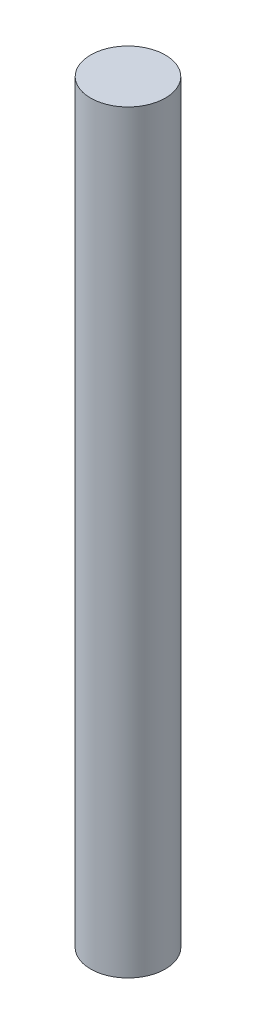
ISO-10303-21;
HEADER;
FILE_DESCRIPTION(('STEP AP214'),'2;1');
FILE_NAME('part.step','',(''),(''),'','','');
FILE_SCHEMA(('AUTOMOTIVE_DESIGN { 1 0 10303 214 1 1 1 1 }'));
ENDSEC;
DATA;
#1=APPLICATION_CONTEXT('core data for automotive mechanical design processes');
#2=APPLICATION_PROTOCOL_DEFINITION('international standard','automotive_design',2000,#1);
#3=PRODUCT_CONTEXT('',#1,'mechanical');
#4=PRODUCT('Part','Part','',(#3));
#5=PRODUCT_RELATED_PRODUCT_CATEGORY('part','',(#4));
#6=PRODUCT_DEFINITION_FORMATION('','',#4);
#7=PRODUCT_DEFINITION_CONTEXT('part definition',#1,'design');
#8=PRODUCT_DEFINITION('design','',#6,#7);
#9=PRODUCT_DEFINITION_SHAPE('','',#8);
#10=(LENGTH_UNIT() NAMED_UNIT(*) SI_UNIT(.MILLI.,.METRE.));
#11=(NAMED_UNIT(*) PLANE_ANGLE_UNIT() SI_UNIT($,.RADIAN.));
#12=(NAMED_UNIT(*) SI_UNIT($,.STERADIAN.) SOLID_ANGLE_UNIT());
#13=UNCERTAINTY_MEASURE_WITH_UNIT(LENGTH_MEASURE(1.E-05),#10,'distance_accuracy_value','');
#14=(GEOMETRIC_REPRESENTATION_CONTEXT(3) GLOBAL_UNCERTAINTY_ASSIGNED_CONTEXT((#13)) GLOBAL_UNIT_ASSIGNED_CONTEXT((#10,
#11,#12)) REPRESENTATION_CONTEXT('',''));
#15=CARTESIAN_POINT('',(0.,0.,0.));
#16=DIRECTION('',(0.,0.,1.));
#17=DIRECTION('',(1.,0.,0.));
#18=AXIS2_PLACEMENT_3D('',#15,#16,#17);
#19=CARTESIAN_POINT('',(0.,100.96,0.));
#20=DIRECTION('',(0.,-1.,0.));
#21=DIRECTION('',(0.,0.,-1.));
#22=AXIS2_PLACEMENT_3D('',#19,#20,#21);
#23=CYLINDRICAL_SURFACE('',#22,5.);
#24=CARTESIAN_POINT('',(0.,100.96,0.));
#25=DIRECTION('',(0.,1.,0.));
#26=DIRECTION('',(0.,0.,1.));
#27=AXIS2_PLACEMENT_3D('',#24,#25,#26);
#28=CIRCLE('',#27,5.);
#29=CARTESIAN_POINT('',(0.,100.96,5.));
#30=VERTEX_POINT('',#29);
#31=EDGE_CURVE('E10',#30,#30,#28,.T.);
#32=ORIENTED_EDGE('',*,*,#31,.F.);
#33=EDGE_LOOP('',(#32));
#34=FACE_BOUND('',#33,.T.);
#35=CARTESIAN_POINT('',(0.,0.,0.));
#36=DIRECTION('',(0.,1.,0.));
#37=DIRECTION('',(0.,0.,1.));
#38=AXIS2_PLACEMENT_3D('',#35,#36,#37);
#39=CIRCLE('',#38,5.);
#40=CARTESIAN_POINT('',(0.,0.,5.));
#41=VERTEX_POINT('',#40);
#42=EDGE_CURVE('E42',#41,#41,#39,.T.);
#43=ORIENTED_EDGE('',*,*,#42,.T.);
#44=EDGE_LOOP('',(#43));
#45=FACE_BOUND('',#44,.T.);
#46=ADVANCED_FACE('F39',(#34,#45),#23,.T.);
#47=CARTESIAN_POINT('',(0.,100.96,0.));
#48=DIRECTION('',(0.,1.,0.));
#49=DIRECTION('',(0.,0.,1.));
#50=AXIS2_PLACEMENT_3D('',#47,#48,#49);
#51=PLANE('',#50);
#52=ORIENTED_EDGE('',*,*,#31,.T.);
#53=EDGE_LOOP('',(#52));
#54=FACE_BOUND('',#53,.T.);
#55=ADVANCED_FACE('F54',(#54),#51,.T.);
#56=CARTESIAN_POINT('',(0.,0.,0.));
#57=DIRECTION('',(0.,1.,0.));
#58=DIRECTION('',(0.,0.,1.));
#59=AXIS2_PLACEMENT_3D('',#56,#57,#58);
#60=PLANE('',#59);
#61=ORIENTED_EDGE('',*,*,#42,.F.);
#62=EDGE_LOOP('',(#61));
#63=FACE_BOUND('',#62,.T.);
#64=ADVANCED_FACE('F52',(#63),#60,.F.);
#65=CLOSED_SHELL('',(#46,#55,#64));
#66=MANIFOLD_SOLID_BREP('B2',#65);
#67=ADVANCED_BREP_SHAPE_REPRESENTATION('',(#18,#66),#14);
#68=SHAPE_DEFINITION_REPRESENTATION(#9,#67);
ENDSEC;
END-ISO-10303-21;
